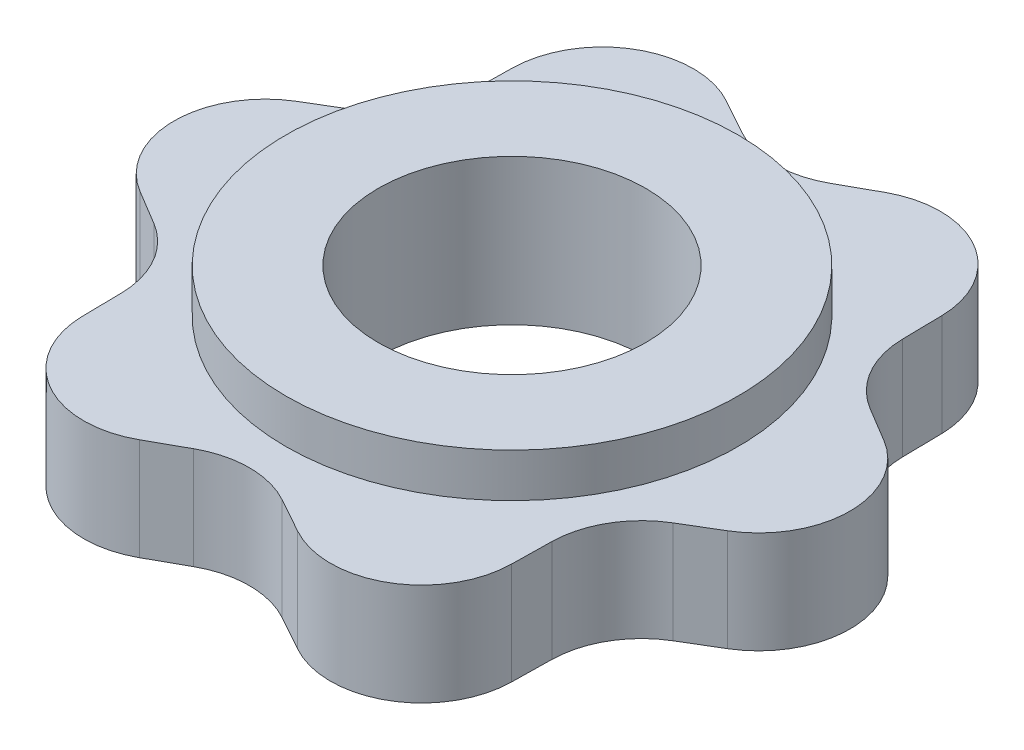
from build123d import *

# Parameters (mm, degrees)
BOSS_EXTRUDE2_DEPTH = 10.668
SKETCH4_R           = 23.622
BOSS_EXTRUDE3_DEPTH = 4.572
SKETCH5_R           = 13.97
CUT_EXTRUDE2_DEPTH  = 50.93316733


with BuildPart() as part:
    # Sketch2 → Boss-Extrude2 (new body)
    with BuildSketch(Plane(origin=(0, 0, 0), x_dir=(1, 0, 0), z_dir=(0, 1, 0))):
        with BuildLine():
            Line((4.627548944, 28.631652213), (8.262951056, 30.652348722))
            ThreePointArc((8.262951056, 30.652348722), (17.653, 30.575892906), (22.414237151, 22.482099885))
            Line((22.414237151, 22.482099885), (22.481963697, 18.32340105))
            ThreePointArc((22.481963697, 18.32340105), (23.756808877, 13.716), (27.109512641, 10.308251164))
            Line((27.109512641, 10.308251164), (30.677188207, 8.170248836))
            ThreePointArc((30.677188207, 8.170248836), (35.306, 0), (30.677188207, -8.170248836))
            Line((30.677188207, -8.170248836), (27.109512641, -10.308251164))
            ThreePointArc((27.109512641, -10.308251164), (23.756808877, -13.716), (22.481963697, -18.32340105))
            Line((22.481963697, -18.32340105), (22.414237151, -22.482099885))
            ThreePointArc((22.414237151, -22.482099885), (17.653, -30.575892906), (8.262951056, -30.652348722))
            Line((8.262951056, -30.652348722), (4.627548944, -28.631652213))
            ThreePointArc((4.627548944, -28.631652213), (0, -27.432), (-4.627548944, -28.631652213))
            Line((-4.627548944, -28.631652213), (-8.262951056, -30.652348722))
            ThreePointArc((-8.262951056, -30.652348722), (-17.653, -30.575892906), (-22.414237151, -22.482099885))
            Line((-22.414237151, -22.482099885), (-22.481963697, -18.32340105))
            ThreePointArc((-22.481963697, -18.32340105), (-23.756808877, -13.716), (-27.109512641, -10.308251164))
            Line((-27.109512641, -10.308251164), (-30.677188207, -8.170248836))
            ThreePointArc((-30.677188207, -8.170248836), (-35.306, 0), (-30.677188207, 8.170248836))
            Line((-30.677188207, 8.170248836), (-27.109512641, 10.308251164))
            ThreePointArc((-27.109512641, 10.308251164), (-23.756808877, 13.716), (-22.481963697, 18.32340105))
            Line((-22.481963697, 18.32340105), (-22.414237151, 22.482099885))
            ThreePointArc((-22.414237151, 22.482099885), (-17.653, 30.575892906), (-8.262951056, 30.652348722))
            Line((-8.262951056, 30.652348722), (-4.627548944, 28.631652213))
            ThreePointArc((-4.627548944, 28.631652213), (0, 27.432), (4.627548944, 28.631652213))
        make_face()
    extrude(amount=BOSS_EXTRUDE2_DEPTH)

    # Sketch4 → Boss-Extrude3 (add)
    with BuildSketch(Plane(origin=(0, 10.668, 0), x_dir=(1, 0, 0), z_dir=(0, 1, 0))):
        with Locations(Location((0, 0, 0), (0, 0, 270))):
            Circle(SKETCH4_R)
    extrude(amount=BOSS_EXTRUDE3_DEPTH)

    # Sketch5 → Cut-Extrude2 (cut, through all)
    with BuildSketch(Plane(origin=(0, 15.24, 0), x_dir=(1, 0, 0), z_dir=(0, 1, 0))):
        with Locations(Location((0, 0, 0), (0, 0, 270))):
            Circle(SKETCH5_R)
    extrude(amount=-CUT_EXTRUDE2_DEPTH, mode=Mode.SUBTRACT)


solid = part.part
